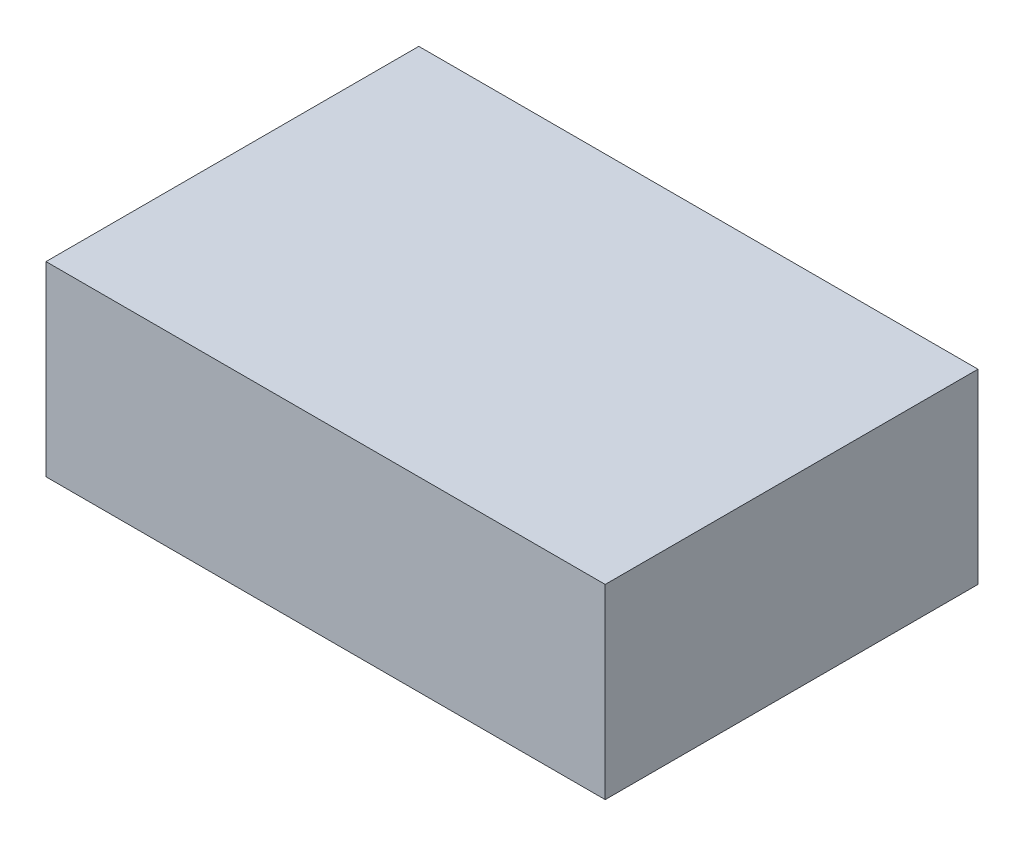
from build123d import *

# Parameters (mm, degrees)
SKIZZE1_W                       = 30
SKIZZE1_H                       = 10
AUFSATZ_LINEAR_AUSTRAGEN1_DEPTH = 10


with BuildPart() as part:
    # Skizze1 → Aufsatz-Linear austragen1 (new, symmetric)
    with BuildSketch(Plane.XY):
        with Locations((15, 5)):
            Rectangle(SKIZZE1_W, SKIZZE1_H)
    extrude(amount=AUFSATZ_LINEAR_AUSTRAGEN1_DEPTH, both=True)


solid = part.part
